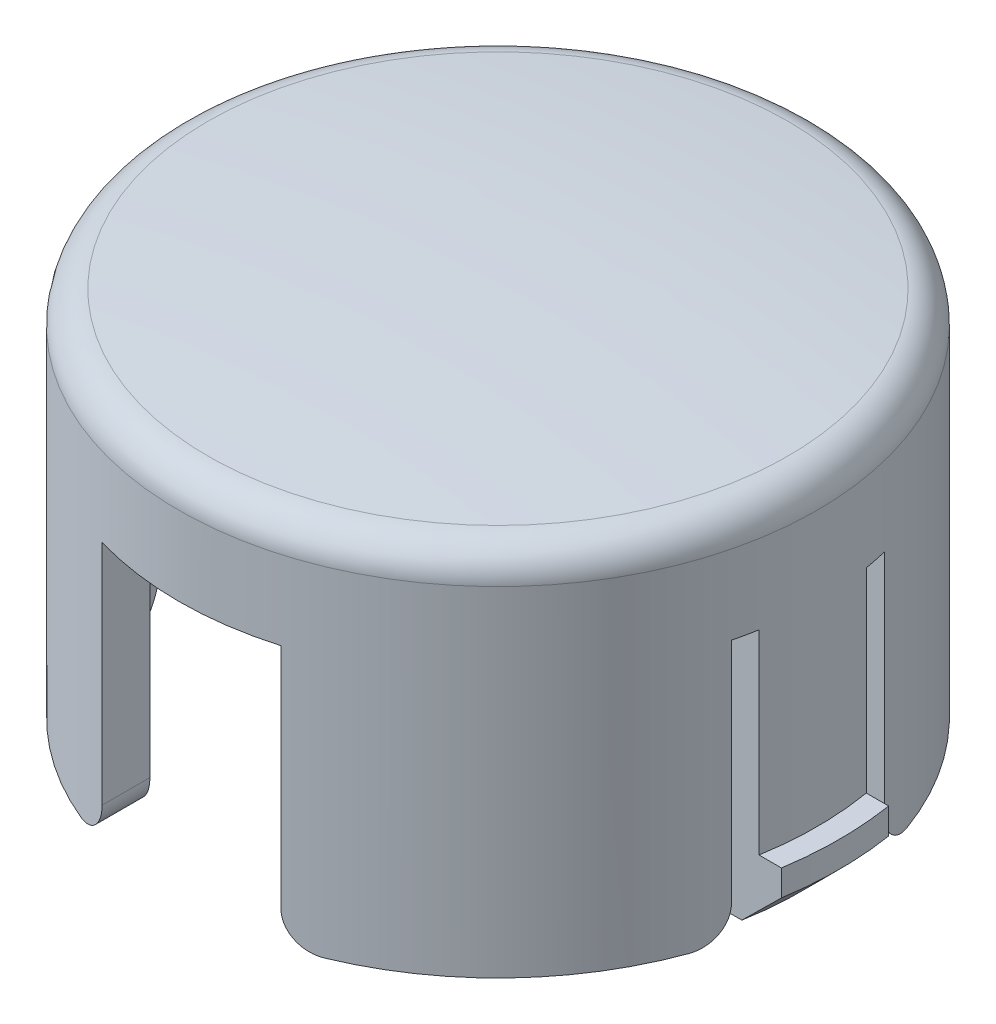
from build123d import *

# Parameters (mm, degrees)
CUTOUT_DEPTH  = 10.16
TAB_START     = -2.54
TAB_DEPTH     = 2.54
TAB_CHMF_SIZE = 1.524
CROSS_START   = 7.62
CROSS_DEPTH   = 7.62
BOX_DEPTH     = 13.059399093
BOXCUT_DEPTH  = 13.059399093
FILLET1_R     = 1.27


with BuildPart() as part:
    # Sketch1 → dome_base (revolve)
    with BuildSketch(Plane.XY, mode=Mode.PRIVATE) as dome_base_sk:
        with BuildLine():
            Line((0, 6.03989106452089), (0, 3.9608901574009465))
            Line((0, 3.9608901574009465), (10.693399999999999, 3.9608901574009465))
            Line((10.693399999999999, 3.9608901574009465), (10.6934, -9.04770893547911))
            Line((10.6934, -9.04770893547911), (12.471400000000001, -9.04770893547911))
            Line((12.471400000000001, -9.047708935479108), (12.4714, 4.195604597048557))
            ThreePointArc((12.4714, 4.195604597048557), (12.144228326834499, 5.046471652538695), (11.33128228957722, 5.458945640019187))
            ThreePointArc((11.33128228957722, 5.458945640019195), (5.673082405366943, 5.894559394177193), (0, 6.039891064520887))
        make_face()
    revolve(dome_base_sk.sketch.rotate(Axis((0, 0, 0), (0, 1, 0)), 90), axis=Axis((0, 0, 0), (0, 1, 0)))

    # Sketch2 → cutout (cut)
    with BuildSketch(Plane.XZ.offset(9.04770893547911)):
        Polygon((-3.4925000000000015, 16.178168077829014), (3.4924999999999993, 16.178168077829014), (3.4924999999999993, -16.178168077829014), (-3.4924999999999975, -16.178168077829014), align=None)
        Polygon((-20.4861189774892, 2.9844999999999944), (20.4861189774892, 2.984499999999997), (20.4861189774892, 2.0954999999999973), (-20.4861189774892, 2.0954999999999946), align=None)
        Polygon((-20.4861189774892, -2.9844999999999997), (-20.4861189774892, -2.0955), (20.4861189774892, -2.0954999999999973), (20.4861189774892, -2.984499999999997), align=None)
    extrude(amount=-CUTOUT_DEPTH, mode=Mode.SUBTRACT)

    # Sketch3 → tab (add)
    with BuildSketch(Plane.XZ.offset(9.04770893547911).offset(TAB_START)):
        with BuildLine():
            Line((-13.16932438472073, -2.0955000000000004), (-12.294091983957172, -2.0954999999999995))
            ThreePointArc((-12.294091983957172, -2.095499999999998), (-12.471400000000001, -2.33e-15), (-12.294091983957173, 2.095499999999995))
            Line((-12.294091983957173, 2.095499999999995), (-13.16932438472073, 2.0955000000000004))
            ThreePointArc((-13.169324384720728, 2.0955000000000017), (-13.334999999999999, 1.63e-15), (-13.169324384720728, -2.095499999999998))
        make_face()
        with BuildLine():
            Line((12.294091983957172, -2.0954999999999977), (13.16932438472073, -2.0955000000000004))
            ThreePointArc((13.169324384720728, -2.095500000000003), (13.29351657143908, -1.0510195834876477), (13.334999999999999, -3.27e-15))
            ThreePointArc((13.334999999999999, 0), (13.29351657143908, 1.0510195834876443), (13.169324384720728, 2.0955000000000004))
            Line((13.16932438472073, 2.0955000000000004), (12.294091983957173, 2.095499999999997))
            ThreePointArc((12.294091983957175, 2.0954999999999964), (12.4714, -5.6e-16), (12.294091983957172, -2.0954999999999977))
        make_face()
    extrude(amount=TAB_DEPTH)

    # tab chmf
    tab_chmf_edges = [part.edges().sort_by_distance(p)[0] for p in [
        (-13.334999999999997, -9.04770893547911, 1.33e-15),
        (13.334999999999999, -9.04770893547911, -1.33e-15),
    ]]
    chamfer(tab_chmf_edges, length=TAB_CHMF_SIZE)

    # Sketch5 → cross (add)
    with BuildSketch(Plane.XZ.offset(-3.9608901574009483).offset(CROSS_START)):
        with BuildLine():
            Line((2.753e-14, -0.7184204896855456), (-0.7184204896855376, 1.227e-14))
            Line((-0.71842048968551, -1.543e-14), (-7.912048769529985, -7.193628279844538))
            ThreePointArc((-7.912048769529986, -7.193628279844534), (-7.561375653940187, -7.561375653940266), (-7.193628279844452, -7.91204876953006))
            Line((-7.193628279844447, -7.9120487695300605), (3.642e-14, -0.7184204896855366))
        make_face()
        with BuildLine():
            Line((7.9120487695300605, -7.193628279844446), (0.7184204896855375, 7.99e-15))
            Line((0.7184204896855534, -8.55e-15), (3.676e-14, -0.7184204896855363))
            Line((2.753e-14, -0.7184204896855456), (7.193628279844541, -7.912048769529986))
            ThreePointArc((7.193628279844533, -7.912048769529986), (7.561375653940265, -7.561375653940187), (7.91204876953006, -7.193628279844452))
        make_face()
        with BuildLine():
            Line((7.193628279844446, 7.9120487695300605), (3.73e-14, 0.7184204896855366))
            Line((1.865e-14, 0.7184204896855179), (0.7184204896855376, 7.43e-15))
            Line((0.7184204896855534, -8.55e-15), (7.912048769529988, 7.193628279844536))
            ThreePointArc((7.912048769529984, 7.193628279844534), (7.5613756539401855, 7.561375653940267), (7.193628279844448, 7.912048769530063))
        make_face()
        Polygon((0.7184204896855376, 7.43e-15), (1.865e-14, 0.7184204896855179), (-0.71842048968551, -1.543e-14), (2.753e-14, -0.7184204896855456), align=None)
        with BuildLine():
            Line((-0.71842048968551, -1.543e-14), (3.693e-14, 0.7184204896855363))
            Line((1.865e-14, 0.7184204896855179), (-7.193628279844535, 7.912048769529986))
            ThreePointArc((-7.193628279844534, 7.912048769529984), (-7.561375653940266, 7.561375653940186), (-7.9120487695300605, 7.19362827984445))
            Line((-7.9120487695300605, 7.193628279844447), (-0.7184204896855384, 1.243e-14))
        make_face()
    extrude(amount=-CROSS_DEPTH)

    # Sketch4 → box (add)
    with BuildSketch(Plane.XZ.offset(-3.9608901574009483)):
        Polygon((-1.6509999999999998, -3.8481), (1.6509999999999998, -3.8481), (1.6509999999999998, 3.8480999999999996), (-1.6509999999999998, 3.848099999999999), align=None)
    extrude(amount=BOX_DEPTH)

    # Sketch6 → boxcut (cut)
    with BuildSketch(Plane.XZ.offset(9.098508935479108)):
        Polygon((0.8889999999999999, 3.0860999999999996), (-0.889, 3.086099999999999), (-0.889, -3.0861), (0.8889999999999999, -3.0861), align=None)
    extrude(amount=-BOXCUT_DEPTH, mode=Mode.SUBTRACT)

    # Fillet1
    fillet1_edges = [part.edges().sort_by_distance(p)[0] for p in [
        (-3.492499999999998, -9.04770893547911, -11.039692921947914),
        (3.4924999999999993, -9.04770893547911, -11.039692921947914),
        (11.188751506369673, -9.04770893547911, -2.9844999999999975),
        (-11.188751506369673, -9.04770893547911, -2.9844999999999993),
        (-3.492500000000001, -9.04770893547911, 11.03969292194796),
        (3.4924999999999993, -9.04770893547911, 11.039692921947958),
        (-11.188751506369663, -9.04770893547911, 2.984499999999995),
        (11.188751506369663, -9.04770893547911, 2.9844999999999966),
    ]]
    fillet(fillet1_edges, radius=FILLET1_R)


solid = part.part
